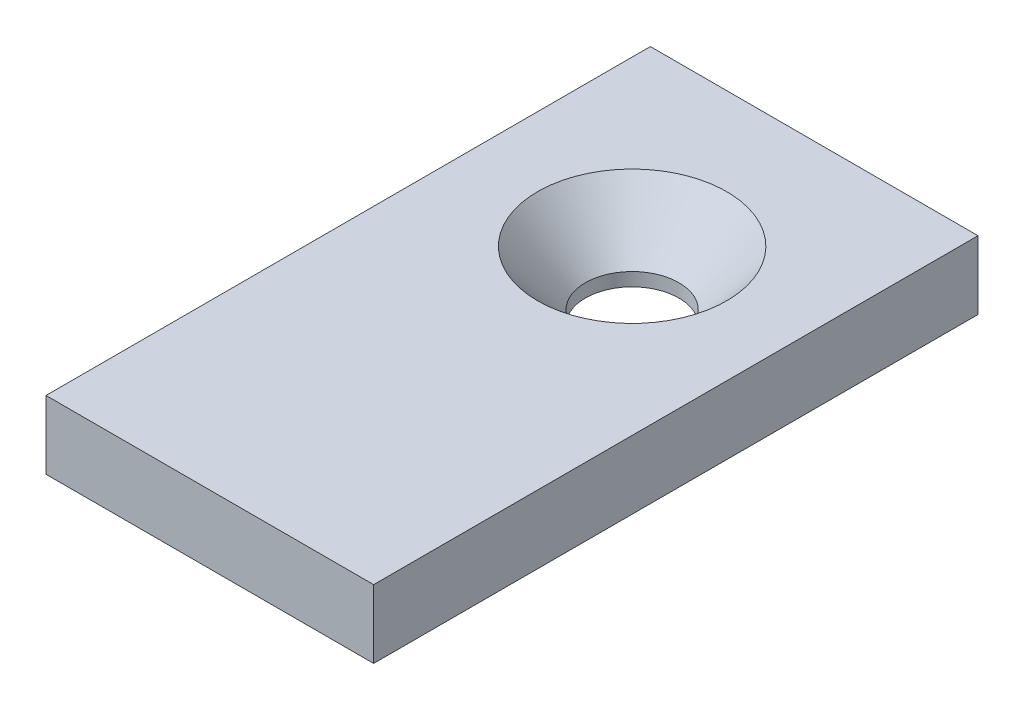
from build123d import *

# Parameters (mm, degrees)
SKETCH1_W      = 11.43
SKETCH1_H      = 2.38125
EXTRUDE1_DEPTH = 21.082


with BuildPart() as part:
    # Sketch1 → Extrude1 (new body)
    with BuildSketch(Plane.XY):
        with Locations((5.715, 0)):
            Rectangle(SKETCH1_W, SKETCH1_H)
    extrude(amount=EXTRUDE1_DEPTH)

    # Sketch2 → CSK for _4 Flat Head Machine Screw _100 (revolve, cut)
    with BuildSketch(Plane(origin=(5.715, 1.190625, 6.35), x_dir=(0, 0, 1), z_dir=(1, 0, 0))):
        Polygon((0, 0), (0, 2.38125), (1.63195, 2.38125), (1.63195, 1.917827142), (3.2990917, 0), align=None)
    revolve(axis=Axis((5.715, 7.540625, 6.35), (0, -1, 0)), mode=Mode.SUBTRACT)


solid = part.part
